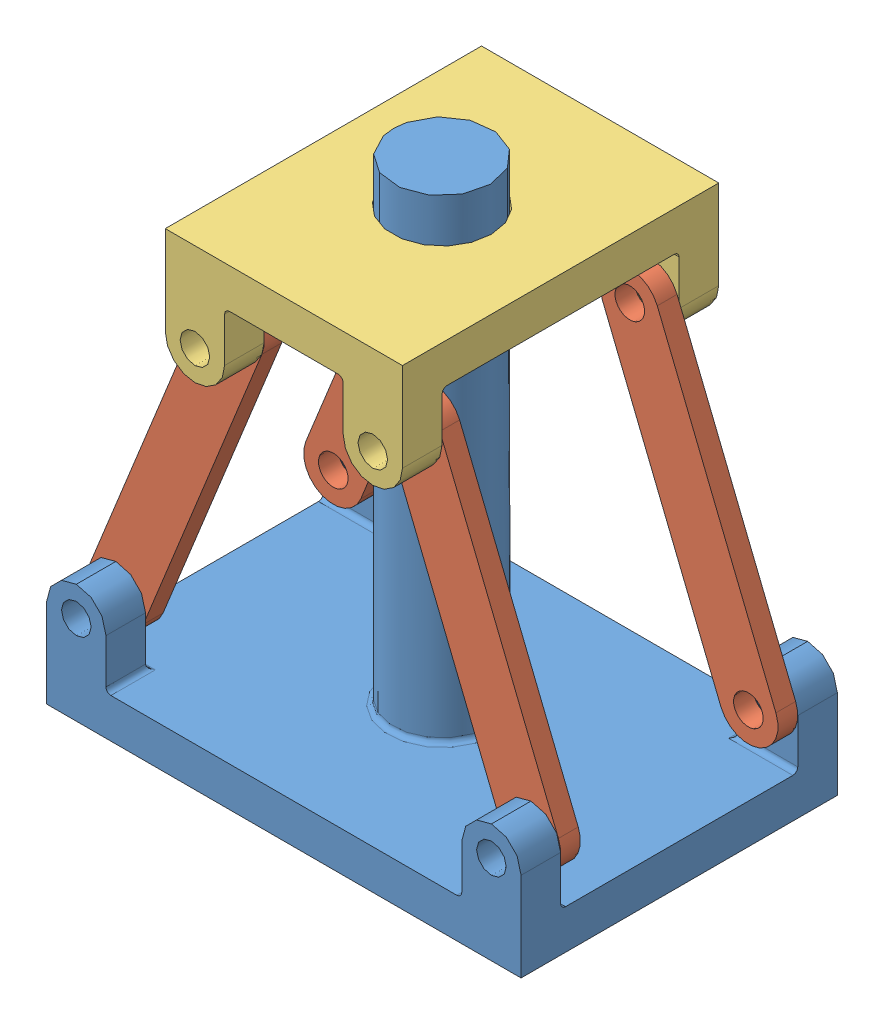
SolidWorks assembly STAND.SLDASM, configuration Default (file format 4400). Lengths in mm.
Overall size (316.31 330.2 203.2).
6 component instances, 3 part files, 18 mates.
Components (placement in the parent):
- STAND BASE PLATE-1: STAND BASE PLATE.SLDPRT [Default] x (-1 0 0) z (0 1 0) size (304.8 203.2 330.2)
- LEG-5: LEG.SLDPRT [Default] at (-57.15 245.5214 69.85) x (-0.375 -0.927025 0) z (0 0 1) size (241.3 38.1 12.7)
- LEG-7: LEG.SLDPRT [Default] at (133.35 57.15 -69.85) x (-0.375 0.927025 0) z (0 0 1) size (241.3 38.1 12.7)
- LEG-8: LEG.SLDPRT [Default] at (133.35 57.15 69.85) x (-0.375 0.927025 0) z (0 0 1) size (241.3 38.1 12.7)
- LEG-9: LEG.SLDPRT [Default] at (-133.35 57.15 -69.85) x (0.375 0.927025 0) z (0 0 1) size (241.3 38.1 12.7)
- TOP PLATE-5: TOP PLATE.SLDPRT [Default] at (0 302.6714 0) x (-1 0 0) z (0 -1 0) size (152.4 203.2 76.2)
Mates (geometry in assembly coordinates):
- Coincident15: coincident anti-aligned: plane of STAND BASE PLATE-1 through (-152.4 76.2 -76.2) normal (0 0 1); plane of LEG-9 through (-133.35 57.15 -76.2) normal (0 0 -1)
- Coincident16: coincident anti-aligned: plane of STAND BASE PLATE-1 through (152.4 76.2 -76.2) normal (0 0 1); plane of LEG-7 through (133.35 57.15 -76.2) normal (0 0 -1)
- Coincident17: coincident anti-aligned: plane of STAND BASE PLATE-1 through (152.4 76.2 76.2) normal (0 0 -1); plane of LEG-8 through (133.35 57.15 76.2) normal (0 0 1)
- Coincident18: coincident anti-aligned: plane of STAND BASE PLATE-1 through (-152.4 76.2 76.2) normal (0 0 -1); plane of LEG-5 through (-57.15 245.5214 76.2) normal (0 0 1)
- Coincident19: coincident anti-aligned: plane of LEG-9 through (-133.35 57.15 -76.2) normal (0 0 -1); plane of TOP PLATE-5 through (-76.2 226.4714 -76.2) normal (0 0 1)
- Coincident20: coincident anti-aligned: plane of LEG-5 through (-57.15 245.5214 76.2) normal (0 0 1); plane of TOP PLATE-5 through (-76.2 226.4714 76.2) normal (0 0 -1)
- Concentric1: concentric aligned: cylinder of LEG-7 through (57.15 245.5214 -63.5) axis (0 0 -1) radius 9.525; cylinder of TOP PLATE-5 through (57.15 245.5214 101.6) axis (0 0 -1) radius 9.525
- Concentric2: concentric aligned: cylinder of STAND BASE PLATE-1 through (133.35 57.15 101.6) axis (0 0 -1) radius 9.525; cylinder of LEG-7 through (133.35 57.15 -63.5) axis (0 0 -1) radius 9.525
- Concentric3: concentric aligned: cylinder of LEG-9 through (-57.15 245.5214 -63.5) axis (0 0 -1) radius 9.525; cylinder of TOP PLATE-5 through (-57.15 245.5214 101.6) axis (0 0 -1) radius 9.525
- Concentric4: concentric aligned: cylinder of STAND BASE PLATE-1 through (-133.35 57.15 101.6) axis (0 0 -1) radius 9.525; cylinder of LEG-9 through (-133.35 57.15 -63.5) axis (0 0 -1) radius 9.525
- Concentric5: concentric anti-aligned: cylinder of STAND BASE PLATE-1 through (-133.35 57.15 -101.6) axis (0 0 1) radius 9.525; cylinder of LEG-5 through (-133.35 57.15 76.2) axis (0 0 -1) radius 9.525
- Concentric6: concentric anti-aligned: cylinder of LEG-5 through (-57.15 245.5214 76.2) axis (0 0 -1) radius 9.525; cylinder of TOP PLATE-5 through (-57.15 245.5214 -101.6) axis (0 0 1) radius 9.525
- Concentric7: concentric anti-aligned: cylinder of LEG-8 through (57.15 245.5214 76.2) axis (0 0 -1) radius 9.525; cylinder of TOP PLATE-5 through (57.15 245.5214 -101.6) axis (0 0 1) radius 9.525
- Concentric8: concentric anti-aligned: cylinder of STAND BASE PLATE-1 through (133.35 57.15 -101.6) axis (0 0 1) radius 9.525; cylinder of LEG-8 through (133.35 57.15 76.2) axis (0 0 -1) radius 9.525
- Coincident21: coincident anti-aligned: plane of STAND BASE PLATE-1 through (152.4 0 -101.6) normal (0 -1 0); plane of assembly through (0 0 0) normal (0 1 0)
- Coincident22: coincident aligned: plane of STAND BASE PLATE-1; plane of assembly through (0 0 0) normal (0 0 1)
- Coincident23: coincident anti-aligned: plane of STAND BASE PLATE-1; plane of assembly through (0 0 0) normal (1 0 0)
- Concentric10: concentric anti-aligned: cylinder of STAND BASE PLATE-1 through (0 330.2 0) axis (0 -1 0) radius 31.115; cylinder of TOP PLATE-5 through (0 277.2714 0) axis (0 1 0) radius 31.75
